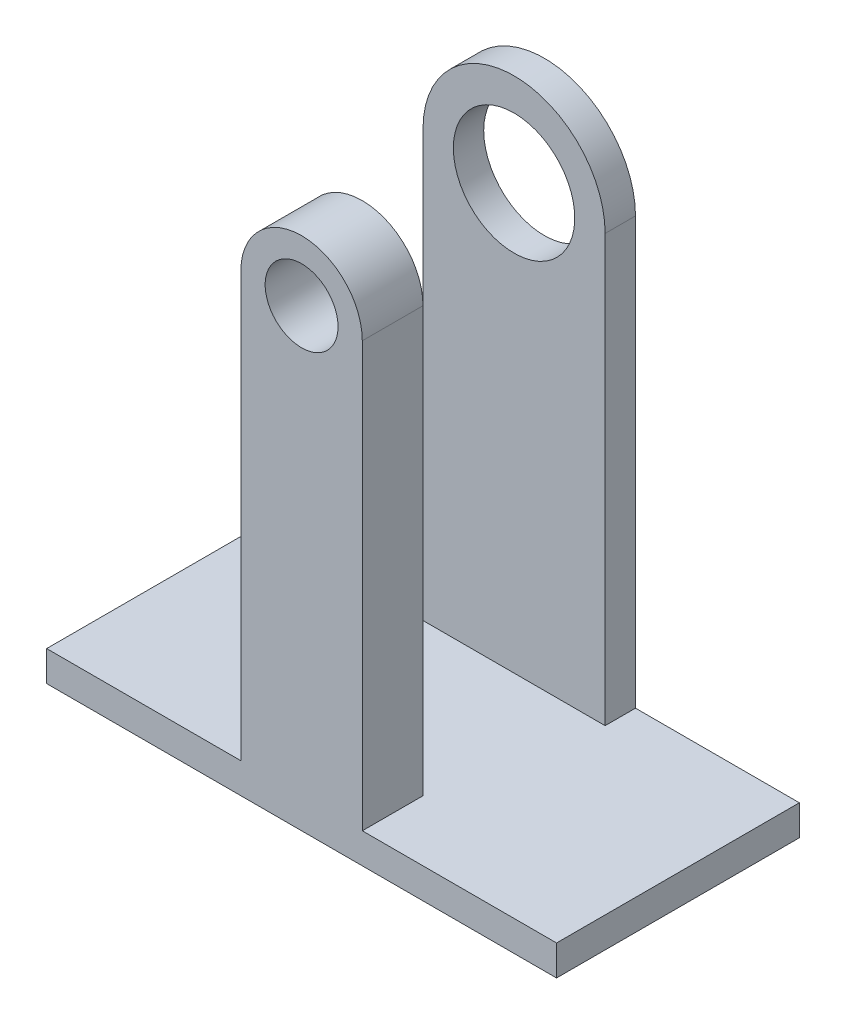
from build123d import *

# Parameters (mm, degrees)
ESQUISSE1_R      = 10
ESQUISSE1_R_2    = 6
EXTRUSION1_DEPTH = 10
EXTRUSION2_START = -10
EXTRUSION2_DEPTH = 10
ESQUISSE3_W      = 84
ESQUISSE3_H      = 5
EXTRUSION3_DEPTH = 40
ESQUISSE4_R      = 10
EXTRUSION4_DEPTH = 5


with BuildPart() as part:
    # Esquisse1 → Extrusion1 (new body)
    with BuildSketch(Plane.XY):
        Circle(ESQUISSE1_R)
        Circle(ESQUISSE1_R_2, mode=Mode.SUBTRACT)
    extrude(amount=EXTRUSION1_DEPTH)

    # Esquisse2 → Extrusion2 (add)
    with BuildSketch(Plane.XY.offset(10).offset(EXTRUSION2_START)):
        with BuildLine():
            Line((-10, 0), (-10, -70))
            Line((-10, -70), (10, -70))
            Line((10, -70), (10, 0))
            ThreePointArc((10, 0), (0, -10), (-10, 0))
        make_face()
    extrude(amount=EXTRUSION2_DEPTH)

    # Esquisse3 → Extrusion3 (add)
    with BuildSketch(Plane.XY.offset(10)):
        with Locations((0, -72.411627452)):
            Rectangle(ESQUISSE3_W, ESQUISSE3_H)
    extrude(amount=-EXTRUSION3_DEPTH)

    # Esquisse4 → Extrusion4 (add)
    with BuildSketch(Plane(origin=(0, 0, -30), x_dir=(-1, 0, 0), z_dir=(0, 0, -1))):
        with BuildLine():
            Line((-15.003732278, 0.311059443), (-15.003732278, -74.911627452))
            Line((-15.003732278, -74.911627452), (14.996267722, -74.911627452))
            Line((14.996267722, -74.911627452), (14.996267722, 0.311059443))
            ThreePointArc((14.996267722, 0.311059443), (-0.003732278, 15.311059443), (-15.003732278, 0.311059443))
        make_face()
        Circle(ESQUISSE4_R, mode=Mode.SUBTRACT)
    extrude(amount=-EXTRUSION4_DEPTH)


solid = part.part
